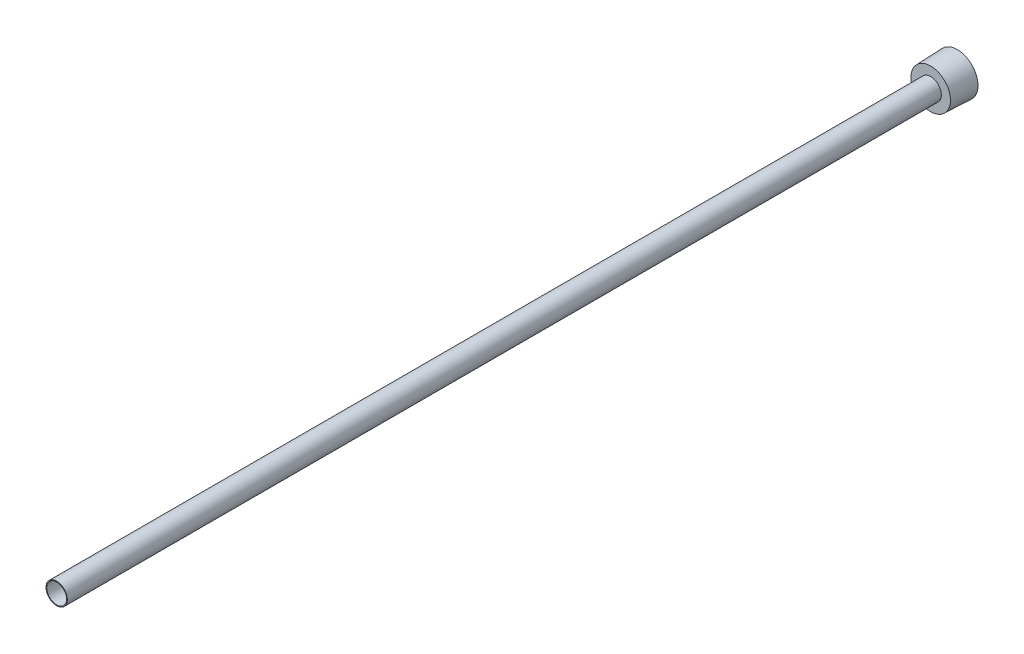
from build123d import *

# Parameters (mm, degrees)
SKETCH2_R          = 5.0419
CUT_EXTRUDE1_DEPTH = 458.442964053
CUT_EXTRUDE2_DEPTH = 9.525


with BuildPart() as part:
    # Sketch1 → Revolve1 (revolve)
    with BuildSketch(Plane(origin=(0, 0, 0), x_dir=(0, 0, -1), z_dir=(1, 0, 0)), mode=Mode.PRIVATE) as revolve1_sk:
        Polygon((0, 10.541), (-13.4874, 10.049032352), (-13.4874, 5.4229), (-457.2, 5.4229), (-457.2, 0), (0, 0), align=None)
    revolve(revolve1_sk.sketch.rotate(Axis((0, 0, 223.212151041), (0, 0, -1)), 90), axis=Axis((0, 0, 223.212151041), (0, 0, -1)))

    # Sketch2 → Cut-Extrude1 (cut, through all)
    with BuildSketch(Plane.XY.offset(457.2)):
        Circle(SKETCH2_R)
    extrude(amount=-CUT_EXTRUDE1_DEPTH, mode=Mode.SUBTRACT)

    # Sketch3 → Cut-Extrude2 (cut)
    with BuildSketch(Plane(origin=(0, 0, 0), x_dir=(-1, 0, 0), z_dir=(0, 0, -1))):
        Polygon((0, -7.332348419), (6.35, -3.666174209), (6.35, 3.666174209), (0, 7.332348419), (-6.35, 3.666174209), (-6.35, -3.666174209), align=None)
    extrude(amount=-CUT_EXTRUDE2_DEPTH, mode=Mode.SUBTRACT)


solid = part.part
